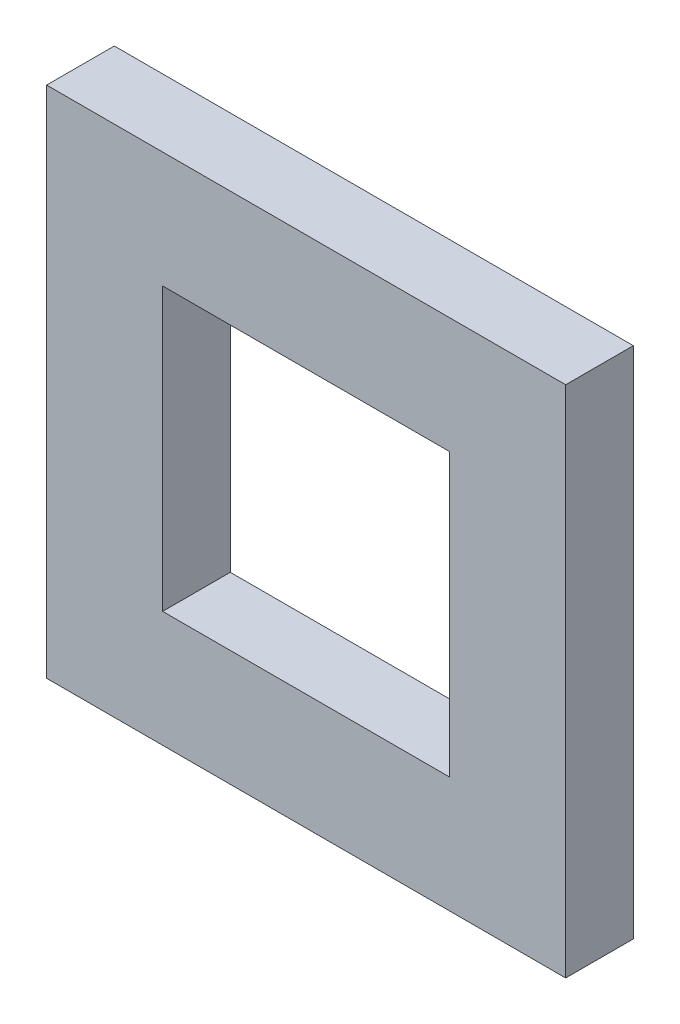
ISO-10303-21;
HEADER;
FILE_DESCRIPTION(('STEP AP214'),'2;1');
FILE_NAME('part.step','',(''),(''),'','','');
FILE_SCHEMA(('AUTOMOTIVE_DESIGN { 1 0 10303 214 1 1 1 1 }'));
ENDSEC;
DATA;
#1=APPLICATION_CONTEXT('core data for automotive mechanical design processes');
#2=APPLICATION_PROTOCOL_DEFINITION('international standard','automotive_design',2000,#1);
#3=PRODUCT_CONTEXT('',#1,'mechanical');
#4=PRODUCT('Part','Part','',(#3));
#5=PRODUCT_RELATED_PRODUCT_CATEGORY('part','',(#4));
#6=PRODUCT_DEFINITION_FORMATION('','',#4);
#7=PRODUCT_DEFINITION_CONTEXT('part definition',#1,'design');
#8=PRODUCT_DEFINITION('design','',#6,#7);
#9=PRODUCT_DEFINITION_SHAPE('','',#8);
#10=(LENGTH_UNIT() NAMED_UNIT(*) SI_UNIT(.MILLI.,.METRE.));
#11=(NAMED_UNIT(*) PLANE_ANGLE_UNIT() SI_UNIT($,.RADIAN.));
#12=(NAMED_UNIT(*) SI_UNIT($,.STERADIAN.) SOLID_ANGLE_UNIT());
#13=UNCERTAINTY_MEASURE_WITH_UNIT(LENGTH_MEASURE(1.E-05),#10,'distance_accuracy_value','');
#14=(GEOMETRIC_REPRESENTATION_CONTEXT(3) GLOBAL_UNCERTAINTY_ASSIGNED_CONTEXT((#13)) GLOBAL_UNIT_ASSIGNED_CONTEXT((#10,
#11,#12)) REPRESENTATION_CONTEXT('',''));
#15=CARTESIAN_POINT('',(0.,0.,0.));
#16=DIRECTION('',(0.,0.,1.));
#17=DIRECTION('',(1.,0.,0.));
#18=AXIS2_PLACEMENT_3D('',#15,#16,#17);
#19=CARTESIAN_POINT('',(0.,0.,22.225));
#20=DIRECTION('',(0.,0.,1.));
#21=DIRECTION('',(1.,0.,0.));
#22=AXIS2_PLACEMENT_3D('',#19,#20,#21);
#23=PLANE('',#22);
#24=DIRECTION('',(0.,-1.,0.));
#25=VECTOR('',#24,1.);
#26=CARTESIAN_POINT('',(-85.2551,84.3915,22.225));
#27=LINE('',#26,#25);
#28=CARTESIAN_POINT('',(-85.2551,84.3915,22.225));
#29=VERTEX_POINT('',#28);
#30=CARTESIAN_POINT('',(-85.2551,-84.3915,22.225));
#31=VERTEX_POINT('',#30);
#32=EDGE_CURVE('E133',#29,#31,#27,.T.);
#33=ORIENTED_EDGE('',*,*,#32,.T.);
#34=DIRECTION('',(1.,0.,0.));
#35=VECTOR('',#34,1.);
#36=CARTESIAN_POINT('',(-85.2551,-84.3915,22.225));
#37=LINE('',#36,#35);
#38=CARTESIAN_POINT('',(85.2551,-84.3915,22.225));
#39=VERTEX_POINT('',#38);
#40=EDGE_CURVE('E136',#31,#39,#37,.T.);
#41=ORIENTED_EDGE('',*,*,#40,.T.);
#42=DIRECTION('',(0.,1.,0.));
#43=VECTOR('',#42,1.);
#44=CARTESIAN_POINT('',(85.2551,84.3915,22.225));
#45=LINE('',#44,#43);
#46=CARTESIAN_POINT('',(85.2551,84.3915,22.225));
#47=VERTEX_POINT('',#46);
#48=EDGE_CURVE('E139',#39,#47,#45,.T.);
#49=ORIENTED_EDGE('',*,*,#48,.T.);
#50=DIRECTION('',(-1.,0.,0.));
#51=VECTOR('',#50,1.);
#52=CARTESIAN_POINT('',(-85.2551,84.3915,22.225));
#53=LINE('',#52,#51);
#54=EDGE_CURVE('E141',#47,#29,#53,.T.);
#55=ORIENTED_EDGE('',*,*,#54,.T.);
#56=EDGE_LOOP('',(#33,#41,#49,#55));
#57=FACE_BOUND('',#56,.T.);
#58=DIRECTION('',(0.,-1.,0.));
#59=VECTOR('',#58,1.);
#60=CARTESIAN_POINT('',(-47.1551,46.2915,22.225));
#61=LINE('',#60,#59);
#62=CARTESIAN_POINT('',(-47.1551,46.2915,22.225));
#63=VERTEX_POINT('',#62);
#64=CARTESIAN_POINT('',(-47.1551,-46.2915,22.225));
#65=VERTEX_POINT('',#64);
#66=EDGE_CURVE('E105',#63,#65,#61,.T.);
#67=ORIENTED_EDGE('',*,*,#66,.F.);
#68=DIRECTION('',(-1.,0.,0.));
#69=VECTOR('',#68,1.);
#70=CARTESIAN_POINT('',(-47.1551,46.2915,22.225));
#71=LINE('',#70,#69);
#72=CARTESIAN_POINT('',(47.1551,46.2915,22.225));
#73=VERTEX_POINT('',#72);
#74=EDGE_CURVE('E97',#73,#63,#71,.T.);
#75=ORIENTED_EDGE('',*,*,#74,.F.);
#76=DIRECTION('',(0.,1.,0.));
#77=VECTOR('',#76,1.);
#78=CARTESIAN_POINT('',(47.1551,46.2915,22.225));
#79=LINE('',#78,#77);
#80=CARTESIAN_POINT('',(47.1551,-46.2915,22.225));
#81=VERTEX_POINT('',#80);
#82=EDGE_CURVE('E119',#81,#73,#79,.T.);
#83=ORIENTED_EDGE('',*,*,#82,.F.);
#84=DIRECTION('',(1.,0.,0.));
#85=VECTOR('',#84,1.);
#86=CARTESIAN_POINT('',(-47.1551,-46.2915,22.225));
#87=LINE('',#86,#85);
#88=EDGE_CURVE('E117',#65,#81,#87,.T.);
#89=ORIENTED_EDGE('',*,*,#88,.F.);
#90=EDGE_LOOP('',(#67,#75,#83,#89));
#91=FACE_BOUND('',#90,.T.);
#92=ADVANCED_FACE('F32',(#57,#91),#23,.T.);
#93=CARTESIAN_POINT('',(0.,0.,0.));
#94=DIRECTION('',(0.,0.,1.));
#95=DIRECTION('',(1.,0.,0.));
#96=AXIS2_PLACEMENT_3D('',#93,#94,#95);
#97=PLANE('',#96);
#98=DIRECTION('',(0.,-1.,0.));
#99=VECTOR('',#98,1.);
#100=CARTESIAN_POINT('',(-85.2551,84.3915,0.));
#101=LINE('',#100,#99);
#102=CARTESIAN_POINT('',(-85.2551,84.3915,0.));
#103=VERTEX_POINT('',#102);
#104=CARTESIAN_POINT('',(-85.2551,-84.3915,0.));
#105=VERTEX_POINT('',#104);
#106=EDGE_CURVE('E113',#103,#105,#101,.T.);
#107=ORIENTED_EDGE('',*,*,#106,.F.);
#108=DIRECTION('',(-1.,0.,0.));
#109=VECTOR('',#108,1.);
#110=CARTESIAN_POINT('',(-85.2551,84.3915,0.));
#111=LINE('',#110,#109);
#112=CARTESIAN_POINT('',(85.2551,84.3915,0.));
#113=VERTEX_POINT('',#112);
#114=EDGE_CURVE('E137',#113,#103,#111,.T.);
#115=ORIENTED_EDGE('',*,*,#114,.F.);
#116=DIRECTION('',(0.,1.,0.));
#117=VECTOR('',#116,1.);
#118=CARTESIAN_POINT('',(85.2551,84.3915,0.));
#119=LINE('',#118,#117);
#120=CARTESIAN_POINT('',(85.2551,-84.3915,0.));
#121=VERTEX_POINT('',#120);
#122=EDGE_CURVE('E148',#121,#113,#119,.T.);
#123=ORIENTED_EDGE('',*,*,#122,.F.);
#124=DIRECTION('',(1.,0.,0.));
#125=VECTOR('',#124,1.);
#126=CARTESIAN_POINT('',(-85.2551,-84.3915,0.));
#127=LINE('',#126,#125);
#128=EDGE_CURVE('E146',#105,#121,#127,.T.);
#129=ORIENTED_EDGE('',*,*,#128,.F.);
#130=EDGE_LOOP('',(#107,#115,#123,#129));
#131=FACE_BOUND('',#130,.T.);
#132=DIRECTION('',(-1.,0.,0.));
#133=VECTOR('',#132,1.);
#134=CARTESIAN_POINT('',(-47.1551,46.2915,0.));
#135=LINE('',#134,#133);
#136=CARTESIAN_POINT('',(47.1551,46.2915,0.));
#137=VERTEX_POINT('',#136);
#138=CARTESIAN_POINT('',(-47.1551,46.2915,0.));
#139=VERTEX_POINT('',#138);
#140=EDGE_CURVE('E55',#137,#139,#135,.T.);
#141=ORIENTED_EDGE('',*,*,#140,.T.);
#142=DIRECTION('',(0.,-1.,0.));
#143=VECTOR('',#142,1.);
#144=CARTESIAN_POINT('',(-47.1551,46.2915,0.));
#145=LINE('',#144,#143);
#146=CARTESIAN_POINT('',(-47.1551,-46.2915,0.));
#147=VERTEX_POINT('',#146);
#148=EDGE_CURVE('E112',#139,#147,#145,.T.);
#149=ORIENTED_EDGE('',*,*,#148,.T.);
#150=DIRECTION('',(1.,0.,0.));
#151=VECTOR('',#150,1.);
#152=CARTESIAN_POINT('',(-47.1551,-46.2915,0.));
#153=LINE('',#152,#151);
#154=CARTESIAN_POINT('',(47.1551,-46.2915,0.));
#155=VERTEX_POINT('',#154);
#156=EDGE_CURVE('E125',#147,#155,#153,.T.);
#157=ORIENTED_EDGE('',*,*,#156,.T.);
#158=DIRECTION('',(0.,1.,0.));
#159=VECTOR('',#158,1.);
#160=CARTESIAN_POINT('',(47.1551,46.2915,0.));
#161=LINE('',#160,#159);
#162=EDGE_CURVE('E106',#155,#137,#161,.T.);
#163=ORIENTED_EDGE('',*,*,#162,.T.);
#164=EDGE_LOOP('',(#141,#149,#157,#163));
#165=FACE_BOUND('',#164,.T.);
#166=ADVANCED_FACE('F166',(#131,#165),#97,.F.);
#167=CARTESIAN_POINT('',(-85.2551,84.3915,22.225));
#168=DIRECTION('',(1.,0.,0.));
#169=DIRECTION('',(0.,1.,0.));
#170=AXIS2_PLACEMENT_3D('',#167,#168,#169);
#171=PLANE('',#170);
#172=ORIENTED_EDGE('',*,*,#106,.T.);
#173=DIRECTION('',(0.,0.,-1.));
#174=VECTOR('',#173,1.);
#175=CARTESIAN_POINT('',(-85.2551,-84.3915,22.225));
#176=LINE('',#175,#174);
#177=EDGE_CURVE('E11',#31,#105,#176,.T.);
#178=ORIENTED_EDGE('',*,*,#177,.F.);
#179=ORIENTED_EDGE('',*,*,#32,.F.);
#180=DIRECTION('',(0.,0.,-1.));
#181=VECTOR('',#180,1.);
#182=CARTESIAN_POINT('',(-85.2551,84.3915,22.225));
#183=LINE('',#182,#181);
#184=EDGE_CURVE('E143',#29,#103,#183,.T.);
#185=ORIENTED_EDGE('',*,*,#184,.T.);
#186=EDGE_LOOP('',(#172,#178,#179,#185));
#187=FACE_BOUND('',#186,.T.);
#188=ADVANCED_FACE('F34',(#187),#171,.F.);
#189=CARTESIAN_POINT('',(-85.2551,-84.3915,22.225));
#190=DIRECTION('',(0.,1.,0.));
#191=DIRECTION('',(-1.,0.,0.));
#192=AXIS2_PLACEMENT_3D('',#189,#190,#191);
#193=PLANE('',#192);
#194=ORIENTED_EDGE('',*,*,#128,.T.);
#195=DIRECTION('',(0.,0.,-1.));
#196=VECTOR('',#195,1.);
#197=CARTESIAN_POINT('',(85.2551,-84.3915,22.225));
#198=LINE('',#197,#196);
#199=EDGE_CURVE('E40',#39,#121,#198,.T.);
#200=ORIENTED_EDGE('',*,*,#199,.F.);
#201=ORIENTED_EDGE('',*,*,#40,.F.);
#202=ORIENTED_EDGE('',*,*,#177,.T.);
#203=EDGE_LOOP('',(#194,#200,#201,#202));
#204=FACE_BOUND('',#203,.T.);
#205=ADVANCED_FACE('F176',(#204),#193,.F.);
#206=CARTESIAN_POINT('',(85.2551,84.3915,22.225));
#207=DIRECTION('',(-1.,0.,0.));
#208=DIRECTION('',(0.,-1.,0.));
#209=AXIS2_PLACEMENT_3D('',#206,#207,#208);
#210=PLANE('',#209);
#211=ORIENTED_EDGE('',*,*,#122,.T.);
#212=DIRECTION('',(0.,0.,-1.));
#213=VECTOR('',#212,1.);
#214=CARTESIAN_POINT('',(85.2551,84.3915,22.225));
#215=LINE('',#214,#213);
#216=EDGE_CURVE('E153',#47,#113,#215,.T.);
#217=ORIENTED_EDGE('',*,*,#216,.F.);
#218=ORIENTED_EDGE('',*,*,#48,.F.);
#219=ORIENTED_EDGE('',*,*,#199,.T.);
#220=EDGE_LOOP('',(#211,#217,#218,#219));
#221=FACE_BOUND('',#220,.T.);
#222=ADVANCED_FACE('F160',(#221),#210,.F.);
#223=CARTESIAN_POINT('',(-85.2551,84.3915,22.225));
#224=DIRECTION('',(0.,-1.,0.));
#225=DIRECTION('',(0.,0.,-1.));
#226=AXIS2_PLACEMENT_3D('',#223,#224,#225);
#227=PLANE('',#226);
#228=ORIENTED_EDGE('',*,*,#114,.T.);
#229=ORIENTED_EDGE('',*,*,#184,.F.);
#230=ORIENTED_EDGE('',*,*,#54,.F.);
#231=ORIENTED_EDGE('',*,*,#216,.T.);
#232=EDGE_LOOP('',(#228,#229,#230,#231));
#233=FACE_BOUND('',#232,.T.);
#234=ADVANCED_FACE('F170',(#233),#227,.F.);
#235=CARTESIAN_POINT('',(-47.1551,46.2915,22.225));
#236=DIRECTION('',(0.,-1.,0.));
#237=DIRECTION('',(0.,0.,-1.));
#238=AXIS2_PLACEMENT_3D('',#235,#236,#237);
#239=PLANE('',#238);
#240=ORIENTED_EDGE('',*,*,#140,.F.);
#241=DIRECTION('',(0.,0.,-1.));
#242=VECTOR('',#241,1.);
#243=CARTESIAN_POINT('',(47.1551,46.2915,22.225));
#244=LINE('',#243,#242);
#245=EDGE_CURVE('E101',#73,#137,#244,.T.);
#246=ORIENTED_EDGE('',*,*,#245,.F.);
#247=ORIENTED_EDGE('',*,*,#74,.T.);
#248=DIRECTION('',(0.,0.,-1.));
#249=VECTOR('',#248,1.);
#250=CARTESIAN_POINT('',(-47.1551,46.2915,22.225));
#251=LINE('',#250,#249);
#252=EDGE_CURVE('E100',#63,#139,#251,.T.);
#253=ORIENTED_EDGE('',*,*,#252,.T.);
#254=EDGE_LOOP('',(#240,#246,#247,#253));
#255=FACE_BOUND('',#254,.T.);
#256=ADVANCED_FACE('F99',(#255),#239,.T.);
#257=CARTESIAN_POINT('',(-47.1551,46.2915,22.225));
#258=DIRECTION('',(1.,0.,0.));
#259=DIRECTION('',(0.,1.,0.));
#260=AXIS2_PLACEMENT_3D('',#257,#258,#259);
#261=PLANE('',#260);
#262=ORIENTED_EDGE('',*,*,#148,.F.);
#263=ORIENTED_EDGE('',*,*,#252,.F.);
#264=ORIENTED_EDGE('',*,*,#66,.T.);
#265=DIRECTION('',(0.,0.,-1.));
#266=VECTOR('',#265,1.);
#267=CARTESIAN_POINT('',(-47.1551,-46.2915,22.225));
#268=LINE('',#267,#266);
#269=EDGE_CURVE('E114',#65,#147,#268,.T.);
#270=ORIENTED_EDGE('',*,*,#269,.T.);
#271=EDGE_LOOP('',(#262,#263,#264,#270));
#272=FACE_BOUND('',#271,.T.);
#273=ADVANCED_FACE('F109',(#272),#261,.T.);
#274=CARTESIAN_POINT('',(-47.1551,-46.2915,22.225));
#275=DIRECTION('',(0.,1.,0.));
#276=DIRECTION('',(0.,0.,1.));
#277=AXIS2_PLACEMENT_3D('',#274,#275,#276);
#278=PLANE('',#277);
#279=ORIENTED_EDGE('',*,*,#156,.F.);
#280=ORIENTED_EDGE('',*,*,#269,.F.);
#281=ORIENTED_EDGE('',*,*,#88,.T.);
#282=DIRECTION('',(0.,0.,-1.));
#283=VECTOR('',#282,1.);
#284=CARTESIAN_POINT('',(47.1551,-46.2915,22.225));
#285=LINE('',#284,#283);
#286=EDGE_CURVE('E47',#81,#155,#285,.T.);
#287=ORIENTED_EDGE('',*,*,#286,.T.);
#288=EDGE_LOOP('',(#279,#280,#281,#287));
#289=FACE_BOUND('',#288,.T.);
#290=ADVANCED_FACE('F199',(#289),#278,.T.);
#291=CARTESIAN_POINT('',(47.1551,46.2915,22.225));
#292=DIRECTION('',(-1.,0.,0.));
#293=DIRECTION('',(0.,-1.,0.));
#294=AXIS2_PLACEMENT_3D('',#291,#292,#293);
#295=PLANE('',#294);
#296=ORIENTED_EDGE('',*,*,#162,.F.);
#297=ORIENTED_EDGE('',*,*,#286,.F.);
#298=ORIENTED_EDGE('',*,*,#82,.T.);
#299=ORIENTED_EDGE('',*,*,#245,.T.);
#300=EDGE_LOOP('',(#296,#297,#298,#299));
#301=FACE_BOUND('',#300,.T.);
#302=ADVANCED_FACE('F203',(#301),#295,.T.);
#303=CLOSED_SHELL('',(#92,#166,#188,#205,#222,#234,#256,#273,#290,#302));
#304=MANIFOLD_SOLID_BREP('B2',#303);
#305=ADVANCED_BREP_SHAPE_REPRESENTATION('',(#18,#304),#14);
#306=SHAPE_DEFINITION_REPRESENTATION(#9,#305);
ENDSEC;
END-ISO-10303-21;
